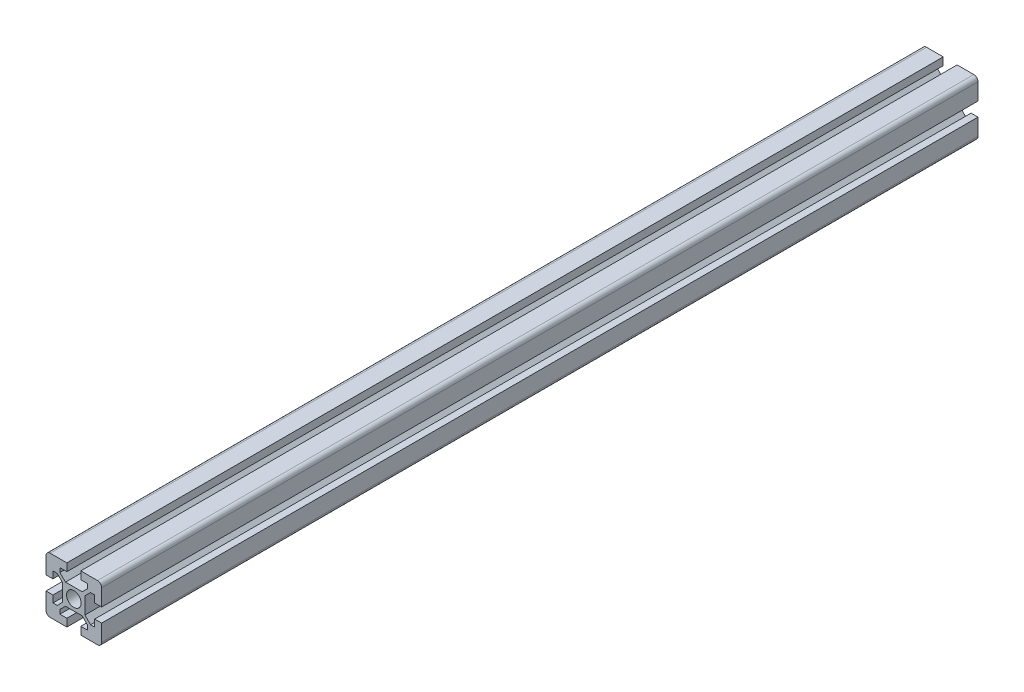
from build123d import *

# Parameters (mm, degrees)
SKETCH_1_R      = 5.25
EXTRUDE_1_DEPTH = 630


with BuildPart() as part:
    # Sketch 1 → Extrude 1 (new body)
    with BuildSketch(Plane.XY):
        with BuildLine():
            Line((10, -5.5), (15, -5.5))
            Line((15, -5.5), (15, 0))
            Line((15, 0), (3, 0))
            ThreePointArc((3, 0), (0.878679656, -0.878679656), (0, -3))
            Line((0, -3), (0, -15))
            Line((0, -15), (5, -15))
            Line((5, -15), (5, -10))
            Line((5, -10), (8, -10))
            Line((8, -10), (12, -14))
            Line((12, -14), (12, -26))
            Line((12, -26), (8, -30))
            Line((8, -30), (5, -30))
            Line((5, -30), (5, -25))
            Line((5, -25), (0, -25))
            Line((0, -25), (0, -37))
            ThreePointArc((0, -37), (0.878679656, -39.121320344), (3, -40))
            Line((3, -40), (15, -40))
            Line((15, -40), (15, -34.5))
            Line((15, -34.5), (10, -34.5))
            Line((10, -34.5), (10, -31.5))
            Line((10, -31.5), (14, -27.5))
            Line((14, -27.5), (26, -27.5))
            Line((26, -27.5), (30, -31.5))
            Line((30, -31.5), (30, -34.5))
            Line((30, -34.5), (25, -34.5))
            Line((25, -34.5), (25, -40))
            Line((25, -40), (37, -40))
            ThreePointArc((37, -40), (39.121320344, -39.121320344), (40, -37))
            Line((40, -37), (40, -25))
            Line((40, -25), (35, -25))
            Line((35, -25), (35, -30))
            Line((35, -30), (32, -30))
            Line((32, -30), (28, -26))
            Line((28, -26), (28, -14))
            Line((28, -14), (32, -10))
            Line((32, -10), (35, -10))
            Line((35, -10), (35, -15))
            Line((35, -15), (40, -15))
            Line((40, -15), (40, -3))
            ThreePointArc((40, -3), (39.121320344, -0.878679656), (37, 0))
            Line((37, 0), (25, 0))
            Line((25, 0), (25, -5.5))
            Line((25, -5.5), (30, -5.5))
            Line((30, -5.5), (30, -8.5))
            Line((30, -8.5), (26, -12.5))
            Line((26, -12.5), (14, -12.5))
            Line((14, -12.5), (10, -8.5))
            Line((10, -8.5), (10, -5.5))
        make_face()
        with Locations((20, -20)):
            Circle(SKETCH_1_R, mode=Mode.SUBTRACT)
    extrude(amount=EXTRUDE_1_DEPTH)


solid = part.part
